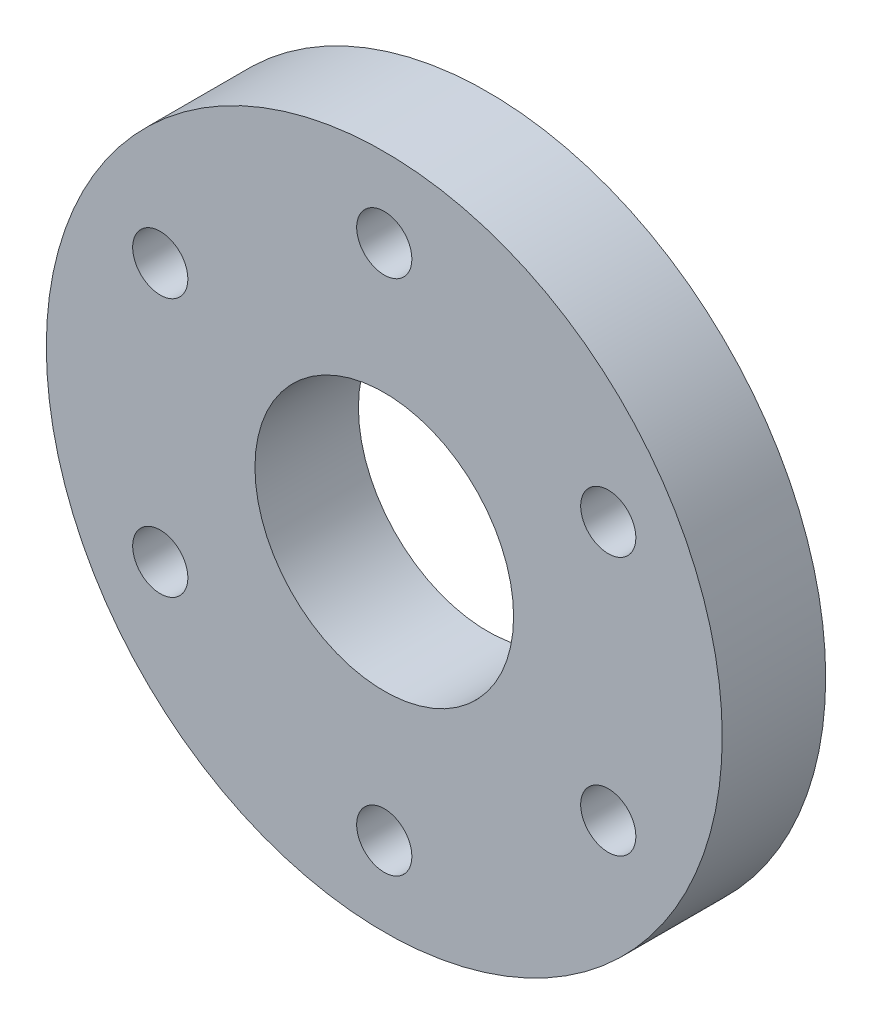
from build123d import *

# Parameters (mm, degrees)
SKETCH1_R           = 24.892
BOSS_EXTRUDE1_DEPTH = 7.62
SKETCH3_R           = 9.525
CUT_EXTRUDE1_DEPTH  = 37.017880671
SKETCH4_R           = 2.032
CUT_EXTRUDE2_DEPTH  = 37.017880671
CIRPATTERN2_COUNT   = 6


with BuildPart() as part:
    # Sketch1 → Boss-Extrude1 (new body)
    with BuildSketch(Plane.XY):
        with Locations(Location((0, 0, 0), (0, 0, 180))):
            Circle(SKETCH1_R)
    extrude(amount=BOSS_EXTRUDE1_DEPTH)

    # Sketch3 → Cut-Extrude1 (cut, through all)
    with BuildSketch(Plane.XY.offset(7.62)):
        Circle(SKETCH3_R)
    extrude(amount=-CUT_EXTRUDE1_DEPTH, mode=Mode.SUBTRACT)

    # Sketch4 → Cut-Extrude2 (cut, through all)
    with BuildSketch(Plane.XY.offset(7.62)):
        with Locations((0, 19.05)):
            Circle(SKETCH4_R)
    cut_extrude2 = extrude(amount=-CUT_EXTRUDE2_DEPTH, mode=Mode.SUBTRACT)

    # CirPattern2: Cut-Extrude2 ×6 about axis
    cirpattern2_axis = Axis((0, 0, 0), (0, 0, 1))
    for i in range(1, CIRPATTERN2_COUNT):
        add(cut_extrude2.rotate(cirpattern2_axis, i * 360 / CIRPATTERN2_COUNT), mode=Mode.SUBTRACT)


solid = part.part
